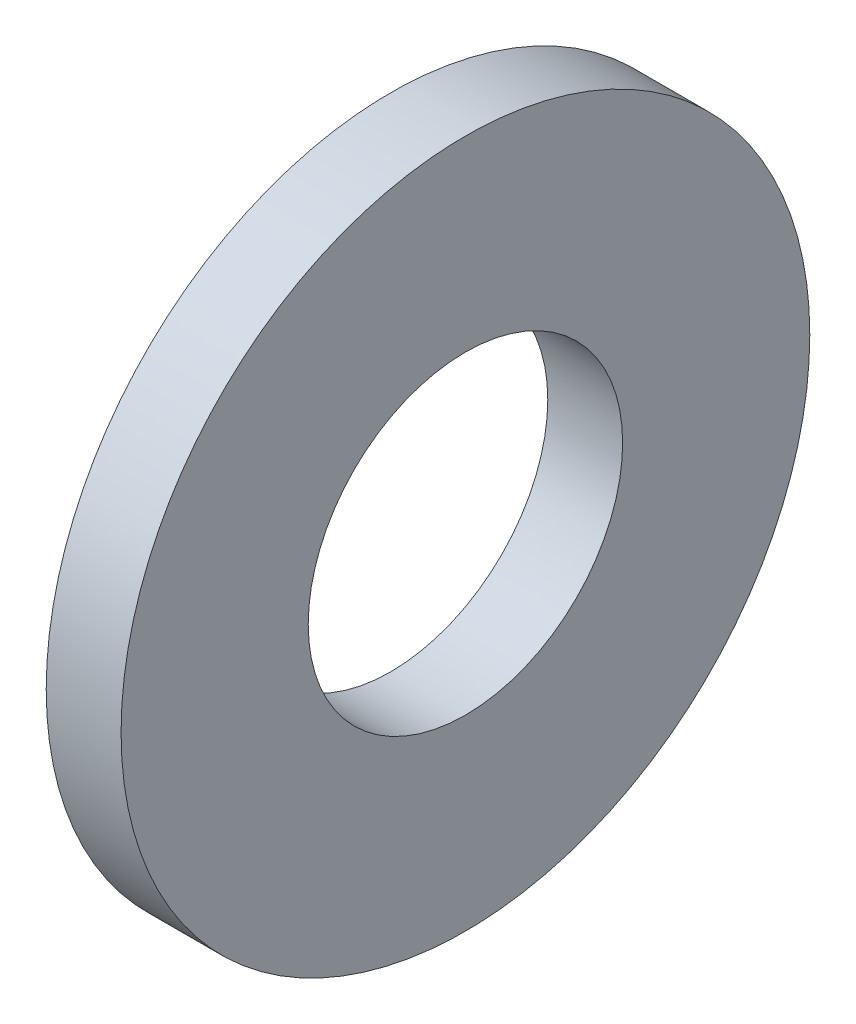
from build123d import *

# Parameters (mm, degrees)
SKETCH1_R          = 11.5
SKETCH1_R_2        = 5.25
BASE_EXTRUDE_DEPTH = 2.5


with BuildPart() as part:
    # Sketch1 → Base-Extrude (new body)
    with BuildSketch(Plane(origin=(0, 0, 0), x_dir=(0, 0, -1), z_dir=(1, 0, 0))):
        Circle(SKETCH1_R)
        Circle(SKETCH1_R_2, mode=Mode.SUBTRACT)
    extrude(amount=BASE_EXTRUDE_DEPTH)


solid = part.part
